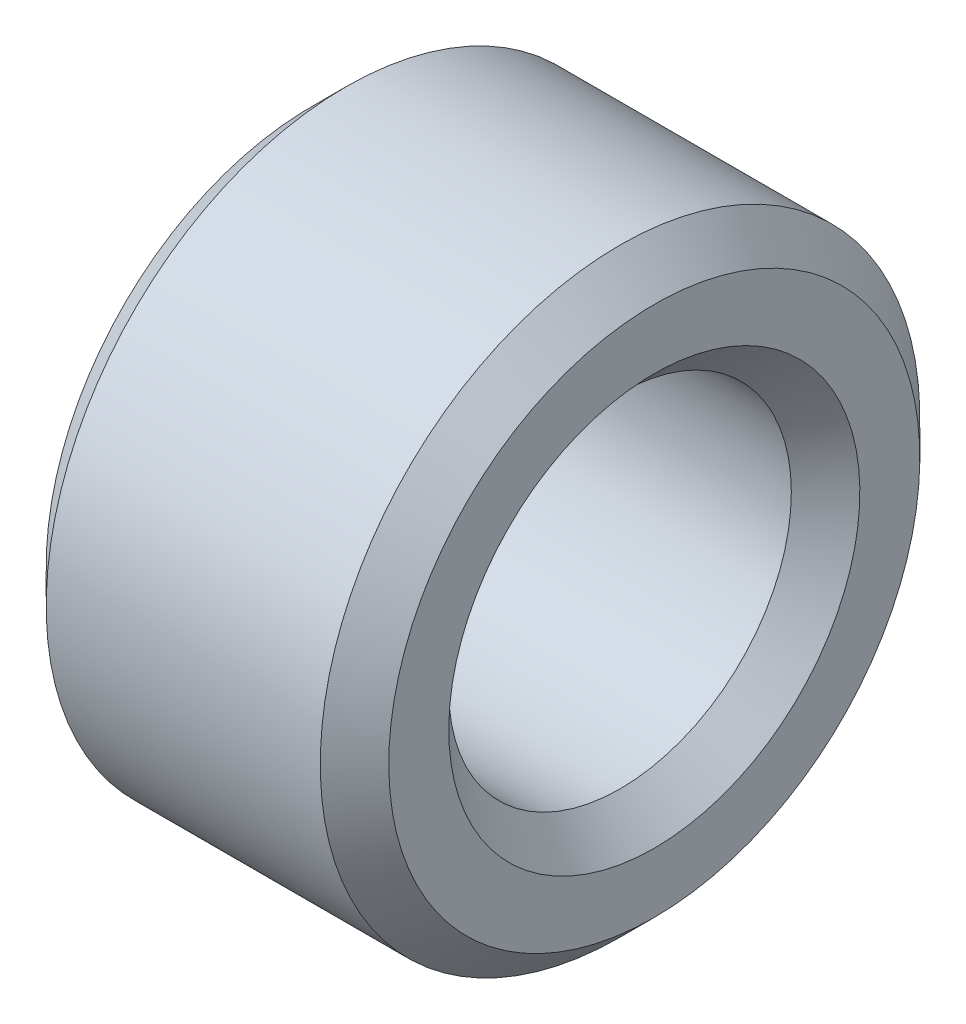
ISO-10303-21;
HEADER;
FILE_DESCRIPTION(('STEP AP214'),'2;1');
FILE_NAME('part.step','',(''),(''),'','','');
FILE_SCHEMA(('AUTOMOTIVE_DESIGN { 1 0 10303 214 1 1 1 1 }'));
ENDSEC;
DATA;
#1=APPLICATION_CONTEXT('core data for automotive mechanical design processes');
#2=APPLICATION_PROTOCOL_DEFINITION('international standard','automotive_design',2000,#1);
#3=PRODUCT_CONTEXT('',#1,'mechanical');
#4=PRODUCT('Part','Part','',(#3));
#5=PRODUCT_RELATED_PRODUCT_CATEGORY('part','',(#4));
#6=PRODUCT_DEFINITION_FORMATION('','',#4);
#7=PRODUCT_DEFINITION_CONTEXT('part definition',#1,'design');
#8=PRODUCT_DEFINITION('design','',#6,#7);
#9=PRODUCT_DEFINITION_SHAPE('','',#8);
#10=(LENGTH_UNIT() NAMED_UNIT(*) SI_UNIT(.MILLI.,.METRE.));
#11=(NAMED_UNIT(*) PLANE_ANGLE_UNIT() SI_UNIT($,.RADIAN.));
#12=(NAMED_UNIT(*) SI_UNIT($,.STERADIAN.) SOLID_ANGLE_UNIT());
#13=UNCERTAINTY_MEASURE_WITH_UNIT(LENGTH_MEASURE(1.E-05),#10,'distance_accuracy_value','');
#14=(GEOMETRIC_REPRESENTATION_CONTEXT(3) GLOBAL_UNCERTAINTY_ASSIGNED_CONTEXT((#13)) GLOBAL_UNIT_ASSIGNED_CONTEXT((#10,
#11,#12)) REPRESENTATION_CONTEXT('',''));
#15=CARTESIAN_POINT('',(0.,0.,0.));
#16=DIRECTION('',(0.,0.,1.));
#17=DIRECTION('',(1.,0.,0.));
#18=AXIS2_PLACEMENT_3D('',#15,#16,#17);
#19=CARTESIAN_POINT('',(0.,-2.75,0.));
#20=DIRECTION('',(-1.,0.,0.));
#21=DIRECTION('',(0.,1.,0.));
#22=AXIS2_PLACEMENT_3D('',#19,#20,#21);
#23=PLANE('',#22);
#24=CARTESIAN_POINT('',(0.,0.,0.));
#25=DIRECTION('',(1.,0.,0.));
#26=DIRECTION('',(0.,-1.,0.));
#27=AXIS2_PLACEMENT_3D('',#24,#25,#26);
#28=CIRCLE('',#27,2.4);
#29=CARTESIAN_POINT('',(0.,-2.4,0.));
#30=VERTEX_POINT('',#29);
#31=EDGE_CURVE('E9',#30,#30,#28,.T.);
#32=ORIENTED_EDGE('',*,*,#31,.T.);
#33=EDGE_LOOP('',(#32));
#34=FACE_BOUND('',#33,.T.);
#35=CARTESIAN_POINT('',(0.,0.,0.));
#36=DIRECTION('',(1.,0.,0.));
#37=DIRECTION('',(0.,-1.,0.));
#38=AXIS2_PLACEMENT_3D('',#35,#36,#37);
#39=CIRCLE('',#38,3.1);
#40=CARTESIAN_POINT('',(0.,-3.1,0.));
#41=VERTEX_POINT('',#40);
#42=EDGE_CURVE('E53',#41,#41,#39,.T.);
#43=ORIENTED_EDGE('',*,*,#42,.F.);
#44=EDGE_LOOP('',(#43));
#45=FACE_BOUND('',#44,.T.);
#46=ADVANCED_FACE('F15',(#34,#45),#23,.T.);
#47=CARTESIAN_POINT('',(0.2,0.,0.));
#48=DIRECTION('',(-1.,0.,0.));
#49=DIRECTION('',(0.,-1.,0.));
#50=AXIS2_PLACEMENT_3D('',#47,#48,#49);
#51=CONICAL_SURFACE('',#50,2.2,0.785398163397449);
#52=CARTESIAN_POINT('',(0.4,0.,0.));
#53=DIRECTION('',(1.,0.,0.));
#54=DIRECTION('',(0.,-1.,0.));
#55=AXIS2_PLACEMENT_3D('',#52,#53,#54);
#56=CIRCLE('',#55,2.);
#57=CARTESIAN_POINT('',(0.4,-2.,0.));
#58=VERTEX_POINT('',#57);
#59=EDGE_CURVE('E22',#58,#58,#56,.T.);
#60=ORIENTED_EDGE('',*,*,#59,.T.);
#61=EDGE_LOOP('',(#60));
#62=FACE_BOUND('',#61,.T.);
#63=ORIENTED_EDGE('',*,*,#31,.F.);
#64=EDGE_LOOP('',(#63));
#65=FACE_BOUND('',#64,.T.);
#66=ADVANCED_FACE('F82',(#62,#65),#51,.F.);
#67=CARTESIAN_POINT('',(2.,0.,0.));
#68=DIRECTION('',(-1.,0.,0.));
#69=DIRECTION('',(0.,-1.,0.));
#70=AXIS2_PLACEMENT_3D('',#67,#68,#69);
#71=CYLINDRICAL_SURFACE('',#70,2.);
#72=CARTESIAN_POINT('',(3.6,0.,0.));
#73=DIRECTION('',(1.,0.,0.));
#74=DIRECTION('',(0.,-1.,0.));
#75=AXIS2_PLACEMENT_3D('',#72,#73,#74);
#76=CIRCLE('',#75,2.);
#77=CARTESIAN_POINT('',(3.6,-2.,0.));
#78=VERTEX_POINT('',#77);
#79=EDGE_CURVE('E58',#78,#78,#76,.T.);
#80=ORIENTED_EDGE('',*,*,#79,.T.);
#81=EDGE_LOOP('',(#80));
#82=FACE_BOUND('',#81,.T.);
#83=ORIENTED_EDGE('',*,*,#59,.F.);
#84=EDGE_LOOP('',(#83));
#85=FACE_BOUND('',#84,.T.);
#86=ADVANCED_FACE('F66',(#82,#85),#71,.F.);
#87=CARTESIAN_POINT('',(3.8,0.,0.));
#88=DIRECTION('',(1.,0.,0.));
#89=DIRECTION('',(0.,-1.,0.));
#90=AXIS2_PLACEMENT_3D('',#87,#88,#89);
#91=CONICAL_SURFACE('',#90,2.2,0.78539816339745);
#92=CARTESIAN_POINT('',(4.,0.,0.));
#93=DIRECTION('',(1.,0.,0.));
#94=DIRECTION('',(0.,-1.,0.));
#95=AXIS2_PLACEMENT_3D('',#92,#93,#94);
#96=CIRCLE('',#95,2.4);
#97=CARTESIAN_POINT('',(4.,-2.4,0.));
#98=VERTEX_POINT('',#97);
#99=EDGE_CURVE('E63',#98,#98,#96,.T.);
#100=ORIENTED_EDGE('',*,*,#99,.T.);
#101=EDGE_LOOP('',(#100));
#102=FACE_BOUND('',#101,.T.);
#103=ORIENTED_EDGE('',*,*,#79,.F.);
#104=EDGE_LOOP('',(#103));
#105=FACE_BOUND('',#104,.T.);
#106=ADVANCED_FACE('F69',(#102,#105),#91,.F.);
#107=CARTESIAN_POINT('',(4.,-2.75,0.));
#108=DIRECTION('',(1.,0.,0.));
#109=DIRECTION('',(0.,-1.,0.));
#110=AXIS2_PLACEMENT_3D('',#107,#108,#109);
#111=PLANE('',#110);
#112=CARTESIAN_POINT('',(4.,0.,0.));
#113=DIRECTION('',(1.,0.,0.));
#114=DIRECTION('',(0.,-1.,0.));
#115=AXIS2_PLACEMENT_3D('',#112,#113,#114);
#116=CIRCLE('',#115,3.1);
#117=CARTESIAN_POINT('',(4.,-3.1,0.));
#118=VERTEX_POINT('',#117);
#119=EDGE_CURVE('E61',#118,#118,#116,.T.);
#120=ORIENTED_EDGE('',*,*,#119,.T.);
#121=EDGE_LOOP('',(#120));
#122=FACE_BOUND('',#121,.T.);
#123=ORIENTED_EDGE('',*,*,#99,.F.);
#124=EDGE_LOOP('',(#123));
#125=FACE_BOUND('',#124,.T.);
#126=ADVANCED_FACE('F71',(#122,#125),#111,.T.);
#127=CARTESIAN_POINT('',(3.8,0.,0.));
#128=DIRECTION('',(-1.,0.,0.));
#129=DIRECTION('',(0.,-1.,0.));
#130=AXIS2_PLACEMENT_3D('',#127,#128,#129);
#131=CONICAL_SURFACE('',#130,3.3,0.785398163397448);
#132=CARTESIAN_POINT('',(3.6,0.,0.));
#133=DIRECTION('',(1.,0.,0.));
#134=DIRECTION('',(0.,-1.,0.));
#135=AXIS2_PLACEMENT_3D('',#132,#133,#134);
#136=CIRCLE('',#135,3.5);
#137=CARTESIAN_POINT('',(3.6,-3.5,0.));
#138=VERTEX_POINT('',#137);
#139=EDGE_CURVE('E55',#138,#138,#136,.T.);
#140=ORIENTED_EDGE('',*,*,#139,.T.);
#141=EDGE_LOOP('',(#140));
#142=FACE_BOUND('',#141,.T.);
#143=ORIENTED_EDGE('',*,*,#119,.F.);
#144=EDGE_LOOP('',(#143));
#145=FACE_BOUND('',#144,.T.);
#146=ADVANCED_FACE('F79',(#142,#145),#131,.T.);
#147=CARTESIAN_POINT('',(2.,0.,0.));
#148=DIRECTION('',(-1.,0.,0.));
#149=DIRECTION('',(0.,-1.,0.));
#150=AXIS2_PLACEMENT_3D('',#147,#148,#149);
#151=CYLINDRICAL_SURFACE('',#150,3.5);
#152=CARTESIAN_POINT('',(0.4,0.,0.));
#153=DIRECTION('',(1.,0.,0.));
#154=DIRECTION('',(0.,-1.,0.));
#155=AXIS2_PLACEMENT_3D('',#152,#153,#154);
#156=CIRCLE('',#155,3.5);
#157=CARTESIAN_POINT('',(0.4,-3.5,0.));
#158=VERTEX_POINT('',#157);
#159=EDGE_CURVE('E49',#158,#158,#156,.T.);
#160=ORIENTED_EDGE('',*,*,#159,.T.);
#161=EDGE_LOOP('',(#160));
#162=FACE_BOUND('',#161,.T.);
#163=ORIENTED_EDGE('',*,*,#139,.F.);
#164=EDGE_LOOP('',(#163));
#165=FACE_BOUND('',#164,.T.);
#166=ADVANCED_FACE('F50',(#162,#165),#151,.T.);
#167=CARTESIAN_POINT('',(0.2,0.,0.));
#168=DIRECTION('',(1.,0.,0.));
#169=DIRECTION('',(0.,-1.,0.));
#170=AXIS2_PLACEMENT_3D('',#167,#168,#169);
#171=CONICAL_SURFACE('',#170,3.3,0.785398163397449);
#172=ORIENTED_EDGE('',*,*,#42,.T.);
#173=EDGE_LOOP('',(#172));
#174=FACE_BOUND('',#173,.T.);
#175=ORIENTED_EDGE('',*,*,#159,.F.);
#176=EDGE_LOOP('',(#175));
#177=FACE_BOUND('',#176,.T.);
#178=ADVANCED_FACE('F92',(#174,#177),#171,.T.);
#179=CLOSED_SHELL('',(#46,#66,#86,#106,#126,#146,#166,#178));
#180=MANIFOLD_SOLID_BREP('B1',#179);
#181=ADVANCED_BREP_SHAPE_REPRESENTATION('',(#18,#180),#14);
#182=SHAPE_DEFINITION_REPRESENTATION(#9,#181);
ENDSEC;
END-ISO-10303-21;
